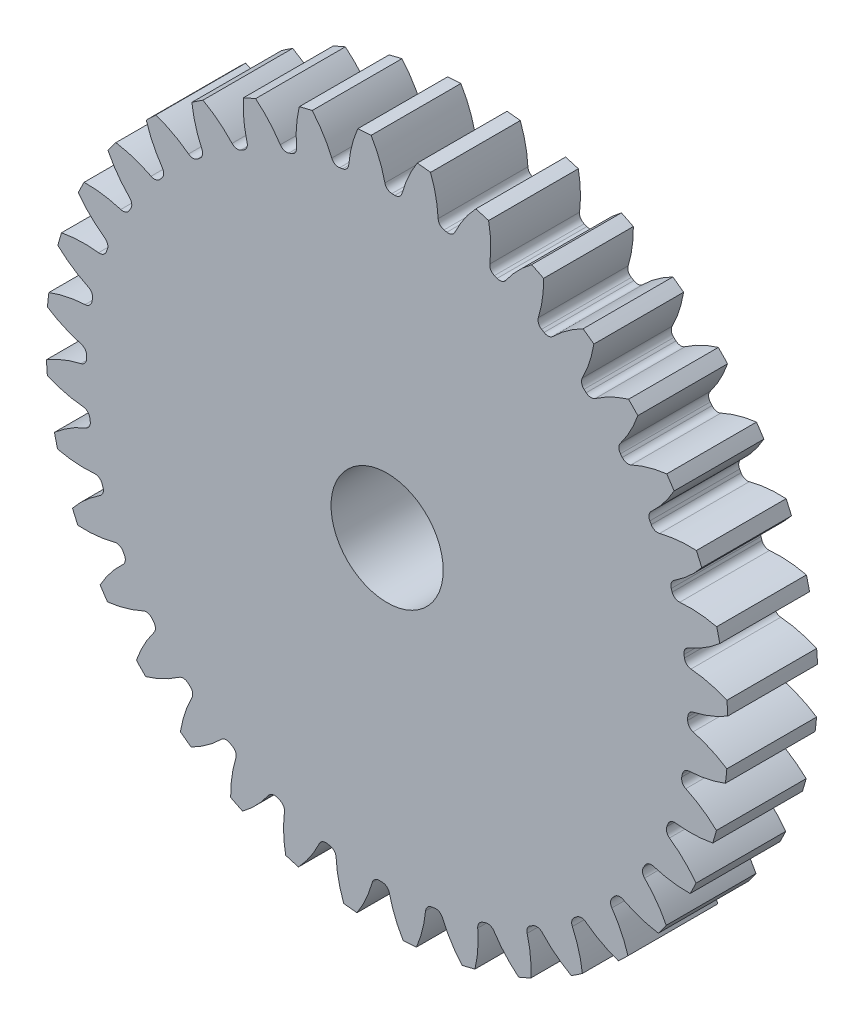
from build123d import *

# Parameters (mm, degrees)
SKETCH3_R         = 386.08
GEARBODY_DEPTH    = 101.6
TOOTHCUT_DEPTH    = 556.372030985
CIRPATTERN1_COUNT = 36
BOREDIA_R         = 63.5
BORE_DEPTH        = 12700


with BuildPart() as part:
    # Sketch3 → gearBody (new body)
    with BuildSketch(Plane.XY):
        Circle(SKETCH3_R)
    extrude(amount=GEARBODY_DEPTH)

    # Sketch2 → toothCut (cut, through all)
    with BuildSketch(Plane.XY):
        with BuildLine():
            ThreePointArc((340.248245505, -8.72129755), (340.286362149, -7.079642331), (340.316558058, -5.437822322))
            ThreePointArc((340.316558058, -5.437822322), (342.165641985, -0.356587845), (346.759168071, 2.496055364))
            ThreePointArc((346.759168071, 2.496055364), (367.059595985, 8.846323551), (386.08, 18.367747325))
            ThreePointArc((386.08, 18.367747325), (386.433051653, -8.039722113), (384.981968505, -34.40965661))
            ThreePointArc((384.981968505, -34.40965661), (366.374037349, -24.105377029), (346.355295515, -16.916270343))
            ThreePointArc((346.355295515, -16.916270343), (341.884391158, -13.87504207), (340.248245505, -8.72129755))
        make_face()
    toothcut = extrude(amount=TOOTHCUT_DEPTH, mode=Mode.SUBTRACT)

    # CirPattern1: toothCut ×36 about axis
    cirpattern1_axis = Axis((0, 0, 0), (0, 0, 1))
    for i in range(1, CIRPATTERN1_COUNT):
        add(toothcut.rotate(cirpattern1_axis, i * 360 / CIRPATTERN1_COUNT), mode=Mode.SUBTRACT)

    # boreDia → bore (cut, symmetric)
    with BuildSketch(Plane.XY):
        Circle(BOREDIA_R)
    extrude(amount=BORE_DEPTH, both=True, mode=Mode.SUBTRACT)


solid = part.part
